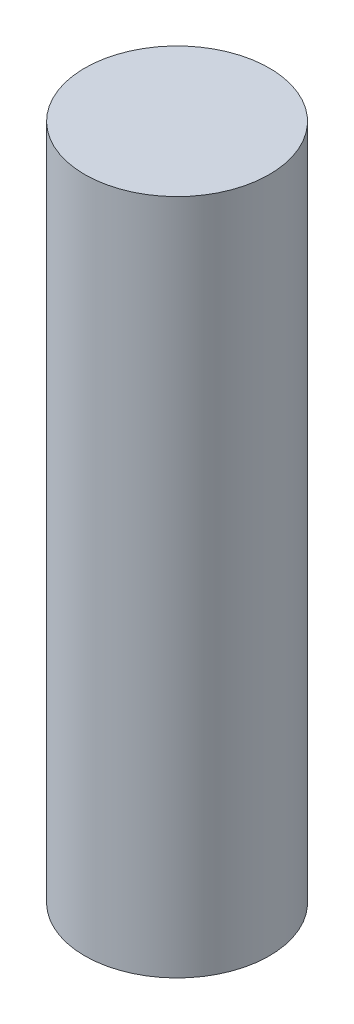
from build123d import *

# Parameters (mm, degrees)
SKETCH1_R           = 4.7625
BOSS_EXTRUDE1_DEPTH = 34.925


with BuildPart() as part:
    # Sketch1 → Boss-Extrude1 (new body)
    with BuildSketch(Plane(origin=(0, 0, 0), x_dir=(1, 0, 0), z_dir=(0, 1, 0))):
        with Locations(Location((0, 0, 0), (0, 0, 270))):
            Circle(SKETCH1_R)
    extrude(amount=BOSS_EXTRUDE1_DEPTH)


solid = part.part
